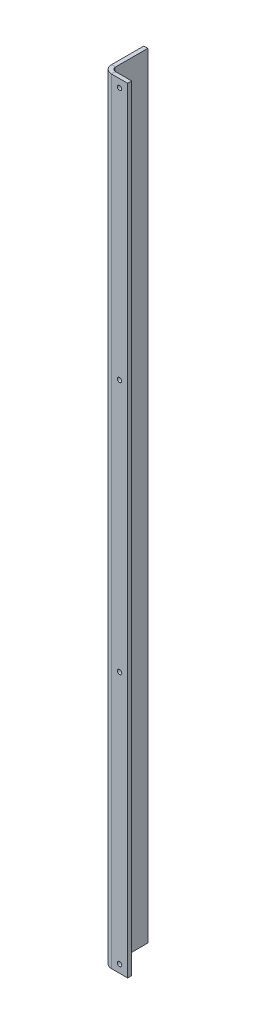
ISO-10303-21;
HEADER;
FILE_DESCRIPTION(('STEP AP214'),'2;1');
FILE_NAME('part.step','',(''),(''),'','','');
FILE_SCHEMA(('AUTOMOTIVE_DESIGN { 1 0 10303 214 1 1 1 1 }'));
ENDSEC;
DATA;
#1=APPLICATION_CONTEXT('core data for automotive mechanical design processes');
#2=APPLICATION_PROTOCOL_DEFINITION('international standard','automotive_design',2000,#1);
#3=PRODUCT_CONTEXT('',#1,'mechanical');
#4=PRODUCT('Part','Part','',(#3));
#5=PRODUCT_RELATED_PRODUCT_CATEGORY('part','',(#4));
#6=PRODUCT_DEFINITION_FORMATION('','',#4);
#7=PRODUCT_DEFINITION_CONTEXT('part definition',#1,'design');
#8=PRODUCT_DEFINITION('design','',#6,#7);
#9=PRODUCT_DEFINITION_SHAPE('','',#8);
#10=(LENGTH_UNIT() NAMED_UNIT(*) SI_UNIT(.MILLI.,.METRE.));
#11=(NAMED_UNIT(*) PLANE_ANGLE_UNIT() SI_UNIT($,.RADIAN.));
#12=(NAMED_UNIT(*) SI_UNIT($,.STERADIAN.) SOLID_ANGLE_UNIT());
#13=UNCERTAINTY_MEASURE_WITH_UNIT(LENGTH_MEASURE(1.E-05),#10,'distance_accuracy_value','');
#14=(GEOMETRIC_REPRESENTATION_CONTEXT(3) GLOBAL_UNCERTAINTY_ASSIGNED_CONTEXT((#13)) GLOBAL_UNIT_ASSIGNED_CONTEXT((#10,
#11,#12)) REPRESENTATION_CONTEXT('',''));
#15=CARTESIAN_POINT('',(0.,0.,0.));
#16=DIRECTION('',(0.,0.,1.));
#17=DIRECTION('',(1.,0.,0.));
#18=AXIS2_PLACEMENT_3D('',#15,#16,#17);
#19=CARTESIAN_POINT('',(0.,1219.2,-12.7));
#20=DIRECTION('',(0.,1.,0.));
#21=DIRECTION('',(0.,0.,1.));
#22=AXIS2_PLACEMENT_3D('',#19,#20,#21);
#23=PLANE('',#22);
#24=DIRECTION('',(1.,0.,0.));
#25=VECTOR('',#24,1.);
#26=CARTESIAN_POINT('',(0.,1219.2,-12.7));
#27=LINE('',#26,#25);
#28=CARTESIAN_POINT('',(0.,1219.2,-12.7));
#29=VERTEX_POINT('',#28);
#30=CARTESIAN_POINT('',(6.35,1219.2,-12.7));
#31=VERTEX_POINT('',#30);
#32=EDGE_CURVE('E51',#29,#31,#27,.T.);
#33=ORIENTED_EDGE('',*,*,#32,.F.);
#34=CARTESIAN_POINT('',(12.7,1219.2,-12.7));
#35=DIRECTION('',(0.,1.,0.));
#36=DIRECTION('',(0.,0.,1.));
#37=AXIS2_PLACEMENT_3D('',#34,#35,#36);
#38=CIRCLE('',#37,12.7);
#39=CARTESIAN_POINT('',(12.7,1219.2,0.));
#40=VERTEX_POINT('',#39);
#41=EDGE_CURVE('E135',#40,#29,#38,.F.);
#42=ORIENTED_EDGE('',*,*,#41,.F.);
#43=DIRECTION('',(0.,0.,1.));
#44=VECTOR('',#43,1.);
#45=CARTESIAN_POINT('',(12.7,1219.2,-6.35));
#46=LINE('',#45,#44);
#47=CARTESIAN_POINT('',(12.7,1219.2,-6.35));
#48=VERTEX_POINT('',#47);
#49=EDGE_CURVE('E176',#48,#40,#46,.T.);
#50=ORIENTED_EDGE('',*,*,#49,.F.);
#51=CARTESIAN_POINT('',(12.7,1219.2,-12.7));
#52=DIRECTION('',(0.,1.,0.));
#53=DIRECTION('',(1.,0.,0.));
#54=AXIS2_PLACEMENT_3D('',#51,#52,#53);
#55=CIRCLE('',#54,6.35);
#56=EDGE_CURVE('E128',#48,#31,#55,.F.);
#57=ORIENTED_EDGE('',*,*,#56,.T.);
#58=EDGE_LOOP('',(#33,#42,#50,#57));
#59=FACE_BOUND('',#58,.T.);
#60=ADVANCED_FACE('F34',(#59),#23,.T.);
#61=CARTESIAN_POINT('',(12.7,1219.2,-6.35));
#62=DIRECTION('',(0.,1.,0.));
#63=DIRECTION('',(0.,0.,1.));
#64=AXIS2_PLACEMENT_3D('',#61,#62,#63);
#65=PLANE('',#64);
#66=DIRECTION('',(0.,0.,-1.));
#67=VECTOR('',#66,1.);
#68=CARTESIAN_POINT('',(0.,1219.2,0.));
#69=LINE('',#68,#67);
#70=CARTESIAN_POINT('',(0.,1219.2,-63.5));
#71=VERTEX_POINT('',#70);
#72=EDGE_CURVE('E269',#29,#71,#69,.T.);
#73=ORIENTED_EDGE('',*,*,#72,.F.);
#74=ORIENTED_EDGE('',*,*,#32,.T.);
#75=DIRECTION('',(0.,0.,-1.));
#76=VECTOR('',#75,1.);
#77=CARTESIAN_POINT('',(6.35,1219.2,0.));
#78=LINE('',#77,#76);
#79=CARTESIAN_POINT('',(6.35,1219.2,-63.5));
#80=VERTEX_POINT('',#79);
#81=EDGE_CURVE('E93',#31,#80,#78,.T.);
#82=ORIENTED_EDGE('',*,*,#81,.T.);
#83=DIRECTION('',(1.,0.,0.));
#84=VECTOR('',#83,1.);
#85=CARTESIAN_POINT('',(0.,1219.2,-63.5));
#86=LINE('',#85,#84);
#87=EDGE_CURVE('E266',#71,#80,#86,.T.);
#88=ORIENTED_EDGE('',*,*,#87,.F.);
#89=EDGE_LOOP('',(#73,#74,#82,#88));
#90=FACE_BOUND('',#89,.T.);
#91=ADVANCED_FACE('F208',(#90),#65,.T.);
#92=CARTESIAN_POINT('',(12.7,0.,0.));
#93=DIRECTION('',(0.,-1.,0.));
#94=DIRECTION('',(0.,0.,-1.));
#95=AXIS2_PLACEMENT_3D('',#92,#93,#94);
#96=PLANE('',#95);
#97=DIRECTION('',(0.,0.,-1.));
#98=VECTOR('',#97,1.);
#99=CARTESIAN_POINT('',(12.7,0.,0.));
#100=LINE('',#99,#98);
#101=CARTESIAN_POINT('',(12.7,0.,0.));
#102=VERTEX_POINT('',#101);
#103=CARTESIAN_POINT('',(12.7,0.,-6.35));
#104=VERTEX_POINT('',#103);
#105=EDGE_CURVE('E80',#102,#104,#100,.T.);
#106=ORIENTED_EDGE('',*,*,#105,.F.);
#107=CARTESIAN_POINT('',(12.7,0.,-12.7));
#108=DIRECTION('',(0.,1.,0.));
#109=DIRECTION('',(0.,0.,1.));
#110=AXIS2_PLACEMENT_3D('',#107,#108,#109);
#111=CIRCLE('',#110,12.7);
#112=CARTESIAN_POINT('',(0.,0.,-12.7));
#113=VERTEX_POINT('',#112);
#114=EDGE_CURVE('E151',#102,#113,#111,.F.);
#115=ORIENTED_EDGE('',*,*,#114,.T.);
#116=DIRECTION('',(-1.,0.,0.));
#117=VECTOR('',#116,1.);
#118=CARTESIAN_POINT('',(6.35,0.,-12.7));
#119=LINE('',#118,#117);
#120=CARTESIAN_POINT('',(6.35,0.,-12.7));
#121=VERTEX_POINT('',#120);
#122=EDGE_CURVE('E87',#121,#113,#119,.T.);
#123=ORIENTED_EDGE('',*,*,#122,.F.);
#124=CARTESIAN_POINT('',(12.7,0.,-12.7));
#125=DIRECTION('',(0.,1.,0.));
#126=DIRECTION('',(1.,0.,0.));
#127=AXIS2_PLACEMENT_3D('',#124,#125,#126);
#128=CIRCLE('',#127,6.35);
#129=EDGE_CURVE('E158',#104,#121,#128,.F.);
#130=ORIENTED_EDGE('',*,*,#129,.F.);
#131=EDGE_LOOP('',(#106,#115,#123,#130));
#132=FACE_BOUND('',#131,.T.);
#133=ADVANCED_FACE('F214',(#132),#96,.T.);
#134=CARTESIAN_POINT('',(6.35,0.,-12.7));
#135=DIRECTION('',(0.,-1.,0.));
#136=DIRECTION('',(0.,0.,-1.));
#137=AXIS2_PLACEMENT_3D('',#134,#135,#136);
#138=PLANE('',#137);
#139=DIRECTION('',(-1.,0.,0.));
#140=VECTOR('',#139,1.);
#141=CARTESIAN_POINT('',(0.,0.,0.));
#142=LINE('',#141,#140);
#143=CARTESIAN_POINT('',(38.1,0.,0.));
#144=VERTEX_POINT('',#143);
#145=EDGE_CURVE('E153',#144,#102,#142,.T.);
#146=ORIENTED_EDGE('',*,*,#145,.T.);
#147=ORIENTED_EDGE('',*,*,#105,.T.);
#148=DIRECTION('',(1.,0.,0.));
#149=VECTOR('',#148,1.);
#150=CARTESIAN_POINT('',(0.,0.,-6.35));
#151=LINE('',#150,#149);
#152=CARTESIAN_POINT('',(38.1,0.,-6.35));
#153=VERTEX_POINT('',#152);
#154=EDGE_CURVE('E156',#153,#104,#151,.F.);
#155=ORIENTED_EDGE('',*,*,#154,.F.);
#156=DIRECTION('',(0.,0.,1.));
#157=VECTOR('',#156,1.);
#158=CARTESIAN_POINT('',(38.1,0.,-6.35));
#159=LINE('',#158,#157);
#160=EDGE_CURVE('E115',#153,#144,#159,.T.);
#161=ORIENTED_EDGE('',*,*,#160,.T.);
#162=EDGE_LOOP('',(#146,#147,#155,#161));
#163=FACE_BOUND('',#162,.T.);
#164=ADVANCED_FACE('F280',(#163),#138,.T.);
#165=CARTESIAN_POINT('',(6.35,1219.2,0.));
#166=DIRECTION('',(-1.,0.,0.));
#167=DIRECTION('',(0.,0.,1.));
#168=AXIS2_PLACEMENT_3D('',#165,#166,#167);
#169=PLANE('',#168);
#170=DIRECTION('',(0.,0.,-1.));
#171=VECTOR('',#170,1.);
#172=CARTESIAN_POINT('',(6.35,0.,0.));
#173=LINE('',#172,#171);
#174=CARTESIAN_POINT('',(6.35,0.,-63.5));
#175=VERTEX_POINT('',#174);
#176=EDGE_CURVE('E141',#121,#175,#173,.T.);
#177=ORIENTED_EDGE('',*,*,#176,.T.);
#178=DIRECTION('',(0.,-1.,0.));
#179=VECTOR('',#178,1.);
#180=CARTESIAN_POINT('',(6.35,1219.2,-63.5));
#181=LINE('',#180,#179);
#182=EDGE_CURVE('E172',#80,#175,#181,.T.);
#183=ORIENTED_EDGE('',*,*,#182,.F.);
#184=ORIENTED_EDGE('',*,*,#81,.F.);
#185=DIRECTION('',(0.,-1.,0.));
#186=VECTOR('',#185,1.);
#187=CARTESIAN_POINT('',(6.35,1219.2,-12.7));
#188=LINE('',#187,#186);
#189=EDGE_CURVE('E140',#31,#121,#188,.T.);
#190=ORIENTED_EDGE('',*,*,#189,.T.);
#191=EDGE_LOOP('',(#177,#183,#184,#190));
#192=FACE_BOUND('',#191,.T.);
#193=ADVANCED_FACE('F286',(#192),#169,.F.);
#194=CARTESIAN_POINT('',(0.,1219.2,-63.5));
#195=DIRECTION('',(0.,0.,-1.));
#196=DIRECTION('',(-1.,0.,0.));
#197=AXIS2_PLACEMENT_3D('',#194,#195,#196);
#198=PLANE('',#197);
#199=DIRECTION('',(1.,0.,0.));
#200=VECTOR('',#199,1.);
#201=CARTESIAN_POINT('',(0.,0.,-63.5));
#202=LINE('',#201,#200);
#203=CARTESIAN_POINT('',(0.,0.,-63.5));
#204=VERTEX_POINT('',#203);
#205=EDGE_CURVE('E144',#204,#175,#202,.T.);
#206=ORIENTED_EDGE('',*,*,#205,.F.);
#207=DIRECTION('',(0.,-1.,0.));
#208=VECTOR('',#207,1.);
#209=CARTESIAN_POINT('',(0.,1219.2,-63.5));
#210=LINE('',#209,#208);
#211=EDGE_CURVE('E170',#71,#204,#210,.T.);
#212=ORIENTED_EDGE('',*,*,#211,.F.);
#213=ORIENTED_EDGE('',*,*,#87,.T.);
#214=ORIENTED_EDGE('',*,*,#182,.T.);
#215=EDGE_LOOP('',(#206,#212,#213,#214));
#216=FACE_BOUND('',#215,.T.);
#217=ADVANCED_FACE('F291',(#216),#198,.T.);
#218=CARTESIAN_POINT('',(0.,1219.2,0.));
#219=DIRECTION('',(-1.,0.,0.));
#220=DIRECTION('',(0.,0.,1.));
#221=AXIS2_PLACEMENT_3D('',#218,#219,#220);
#222=PLANE('',#221);
#223=DIRECTION('',(0.,0.,-1.));
#224=VECTOR('',#223,1.);
#225=CARTESIAN_POINT('',(0.,0.,0.));
#226=LINE('',#225,#224);
#227=EDGE_CURVE('E148',#113,#204,#226,.T.);
#228=ORIENTED_EDGE('',*,*,#227,.F.);
#229=DIRECTION('',(0.,-1.,0.));
#230=VECTOR('',#229,1.);
#231=CARTESIAN_POINT('',(0.,1219.2,-12.7));
#232=LINE('',#231,#230);
#233=EDGE_CURVE('E167',#29,#113,#232,.T.);
#234=ORIENTED_EDGE('',*,*,#233,.F.);
#235=ORIENTED_EDGE('',*,*,#72,.T.);
#236=ORIENTED_EDGE('',*,*,#211,.T.);
#237=EDGE_LOOP('',(#228,#234,#235,#236));
#238=FACE_BOUND('',#237,.T.);
#239=ADVANCED_FACE('F202',(#238),#222,.T.);
#240=CARTESIAN_POINT('',(12.7,1219.2,-12.7));
#241=DIRECTION('',(0.,-1.,0.));
#242=DIRECTION('',(0.,0.,-1.));
#243=AXIS2_PLACEMENT_3D('',#240,#241,#242);
#244=CYLINDRICAL_SURFACE('',#243,12.7);
#245=ORIENTED_EDGE('',*,*,#114,.F.);
#246=DIRECTION('',(0.,-1.,0.));
#247=VECTOR('',#246,1.);
#248=CARTESIAN_POINT('',(12.7,1219.2,0.));
#249=LINE('',#248,#247);
#250=EDGE_CURVE('E164',#40,#102,#249,.T.);
#251=ORIENTED_EDGE('',*,*,#250,.F.);
#252=ORIENTED_EDGE('',*,*,#41,.T.);
#253=ORIENTED_EDGE('',*,*,#233,.T.);
#254=EDGE_LOOP('',(#245,#251,#252,#253));
#255=FACE_BOUND('',#254,.T.);
#256=ADVANCED_FACE('F194',(#255),#244,.T.);
#257=CARTESIAN_POINT('',(0.,1219.2,0.));
#258=DIRECTION('',(0.,0.,1.));
#259=DIRECTION('',(1.,0.,0.));
#260=AXIS2_PLACEMENT_3D('',#257,#258,#259);
#261=PLANE('',#260);
#262=CARTESIAN_POINT('',(25.4,808.56836,0.));
#263=DIRECTION('',(0.,0.,1.));
#264=DIRECTION('',(1.,0.,0.));
#265=AXIS2_PLACEMENT_3D('',#262,#263,#264);
#266=CIRCLE('',#265,3.429);
#267=CARTESIAN_POINT('',(28.829,808.56836,0.));
#268=VERTEX_POINT('',#267);
#269=EDGE_CURVE('E261',#268,#268,#266,.T.);
#270=ORIENTED_EDGE('',*,*,#269,.F.);
#271=EDGE_LOOP('',(#270));
#272=FACE_BOUND('',#271,.T.);
#273=CARTESIAN_POINT('',(25.4,1206.5,0.));
#274=DIRECTION('',(0.,0.,1.));
#275=DIRECTION('',(1.,0.,0.));
#276=AXIS2_PLACEMENT_3D('',#273,#274,#275);
#277=CIRCLE('',#276,3.429);
#278=CARTESIAN_POINT('',(28.829,1206.5,0.));
#279=VERTEX_POINT('',#278);
#280=EDGE_CURVE('E182',#279,#279,#277,.T.);
#281=ORIENTED_EDGE('',*,*,#280,.F.);
#282=EDGE_LOOP('',(#281));
#283=FACE_BOUND('',#282,.T.);
#284=ORIENTED_EDGE('',*,*,#145,.F.);
#285=DIRECTION('',(0.,-1.,0.));
#286=VECTOR('',#285,1.);
#287=CARTESIAN_POINT('',(38.1,1219.2,0.));
#288=LINE('',#287,#286);
#289=CARTESIAN_POINT('',(38.1,1219.2,0.));
#290=VERTEX_POINT('',#289);
#291=EDGE_CURVE('E117',#290,#144,#288,.T.);
#292=ORIENTED_EDGE('',*,*,#291,.F.);
#293=DIRECTION('',(-1.,0.,0.));
#294=VECTOR('',#293,1.);
#295=CARTESIAN_POINT('',(0.,1219.2,0.));
#296=LINE('',#295,#294);
#297=EDGE_CURVE('E133',#290,#40,#296,.T.);
#298=ORIENTED_EDGE('',*,*,#297,.T.);
#299=ORIENTED_EDGE('',*,*,#250,.T.);
#300=EDGE_LOOP('',(#284,#292,#298,#299));
#301=FACE_BOUND('',#300,.T.);
#302=CARTESIAN_POINT('',(25.4,410.63672,0.));
#303=DIRECTION('',(0.,0.,1.));
#304=DIRECTION('',(1.,0.,0.));
#305=AXIS2_PLACEMENT_3D('',#302,#303,#304);
#306=CIRCLE('',#305,3.429);
#307=CARTESIAN_POINT('',(28.829,410.63672,0.));
#308=VERTEX_POINT('',#307);
#309=EDGE_CURVE('E179',#308,#308,#306,.T.);
#310=ORIENTED_EDGE('',*,*,#309,.F.);
#311=EDGE_LOOP('',(#310));
#312=FACE_BOUND('',#311,.T.);
#313=CARTESIAN_POINT('',(25.4,12.7050799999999,0.));
#314=DIRECTION('',(0.,0.,1.));
#315=DIRECTION('',(1.,0.,0.));
#316=AXIS2_PLACEMENT_3D('',#313,#314,#315);
#317=CIRCLE('',#316,3.429);
#318=CARTESIAN_POINT('',(28.829,12.7050799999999,0.));
#319=VERTEX_POINT('',#318);
#320=EDGE_CURVE('E43',#319,#319,#317,.T.);
#321=ORIENTED_EDGE('',*,*,#320,.F.);
#322=EDGE_LOOP('',(#321));
#323=FACE_BOUND('',#322,.T.);
#324=ADVANCED_FACE('F192',(#272,#283,#301,#312,#323),#261,.T.);
#325=CARTESIAN_POINT('',(38.1,1219.2,-6.35));
#326=DIRECTION('',(1.,0.,0.));
#327=DIRECTION('',(0.,0.,-1.));
#328=AXIS2_PLACEMENT_3D('',#325,#326,#327);
#329=PLANE('',#328);
#330=ORIENTED_EDGE('',*,*,#160,.F.);
#331=DIRECTION('',(0.,-1.,0.));
#332=VECTOR('',#331,1.);
#333=CARTESIAN_POINT('',(38.1,1219.2,-6.35));
#334=LINE('',#333,#332);
#335=CARTESIAN_POINT('',(38.1,1219.2,-6.35));
#336=VERTEX_POINT('',#335);
#337=EDGE_CURVE('E109',#336,#153,#334,.T.);
#338=ORIENTED_EDGE('',*,*,#337,.F.);
#339=DIRECTION('',(0.,0.,1.));
#340=VECTOR('',#339,1.);
#341=CARTESIAN_POINT('',(38.1,1219.2,-6.35));
#342=LINE('',#341,#340);
#343=EDGE_CURVE('E113',#336,#290,#342,.T.);
#344=ORIENTED_EDGE('',*,*,#343,.T.);
#345=ORIENTED_EDGE('',*,*,#291,.T.);
#346=EDGE_LOOP('',(#330,#338,#344,#345));
#347=FACE_BOUND('',#346,.T.);
#348=ADVANCED_FACE('F111',(#347),#329,.T.);
#349=CARTESIAN_POINT('',(0.,1219.2,-6.35));
#350=DIRECTION('',(0.,0.,1.));
#351=DIRECTION('',(1.,0.,0.));
#352=AXIS2_PLACEMENT_3D('',#349,#350,#351);
#353=PLANE('',#352);
#354=CARTESIAN_POINT('',(25.4,808.56836,-6.35));
#355=DIRECTION('',(0.,0.,1.));
#356=DIRECTION('',(1.,0.,0.));
#357=AXIS2_PLACEMENT_3D('',#354,#355,#356);
#358=CIRCLE('',#357,3.429);
#359=CARTESIAN_POINT('',(28.829,808.56836,-6.35));
#360=VERTEX_POINT('',#359);
#361=EDGE_CURVE('E259',#360,#360,#358,.T.);
#362=ORIENTED_EDGE('',*,*,#361,.T.);
#363=EDGE_LOOP('',(#362));
#364=FACE_BOUND('',#363,.T.);
#365=CARTESIAN_POINT('',(25.4,1206.5,-6.35));
#366=DIRECTION('',(0.,0.,1.));
#367=DIRECTION('',(1.,0.,0.));
#368=AXIS2_PLACEMENT_3D('',#365,#366,#367);
#369=CIRCLE('',#368,3.429);
#370=CARTESIAN_POINT('',(28.829,1206.5,-6.35));
#371=VERTEX_POINT('',#370);
#372=EDGE_CURVE('E145',#371,#371,#369,.T.);
#373=ORIENTED_EDGE('',*,*,#372,.T.);
#374=EDGE_LOOP('',(#373));
#375=FACE_BOUND('',#374,.T.);
#376=ORIENTED_EDGE('',*,*,#154,.T.);
#377=DIRECTION('',(0.,-1.,0.));
#378=VECTOR('',#377,1.);
#379=CARTESIAN_POINT('',(12.7,1219.2,-6.35));
#380=LINE('',#379,#378);
#381=EDGE_CURVE('E118',#48,#104,#380,.T.);
#382=ORIENTED_EDGE('',*,*,#381,.F.);
#383=DIRECTION('',(1.,0.,0.));
#384=VECTOR('',#383,1.);
#385=CARTESIAN_POINT('',(0.,1219.2,-6.35));
#386=LINE('',#385,#384);
#387=EDGE_CURVE('E122',#336,#48,#386,.F.);
#388=ORIENTED_EDGE('',*,*,#387,.F.);
#389=ORIENTED_EDGE('',*,*,#337,.T.);
#390=EDGE_LOOP('',(#376,#382,#388,#389));
#391=FACE_BOUND('',#390,.T.);
#392=CARTESIAN_POINT('',(25.4,410.63672,-6.35));
#393=DIRECTION('',(0.,0.,1.));
#394=DIRECTION('',(1.,0.,0.));
#395=AXIS2_PLACEMENT_3D('',#392,#393,#394);
#396=CIRCLE('',#395,3.429);
#397=CARTESIAN_POINT('',(28.829,410.63672,-6.35));
#398=VERTEX_POINT('',#397);
#399=EDGE_CURVE('E185',#398,#398,#396,.T.);
#400=ORIENTED_EDGE('',*,*,#399,.T.);
#401=EDGE_LOOP('',(#400));
#402=FACE_BOUND('',#401,.T.);
#403=CARTESIAN_POINT('',(25.4,12.7050799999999,-6.35));
#404=DIRECTION('',(0.,0.,1.));
#405=DIRECTION('',(1.,0.,0.));
#406=AXIS2_PLACEMENT_3D('',#403,#404,#405);
#407=CIRCLE('',#406,3.429);
#408=CARTESIAN_POINT('',(28.829,12.7050799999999,-6.35));
#409=VERTEX_POINT('',#408);
#410=EDGE_CURVE('E11',#409,#409,#407,.T.);
#411=ORIENTED_EDGE('',*,*,#410,.T.);
#412=EDGE_LOOP('',(#411));
#413=FACE_BOUND('',#412,.T.);
#414=ADVANCED_FACE('F123',(#364,#375,#391,#402,#413),#353,.F.);
#415=CARTESIAN_POINT('',(12.7,1219.2,-12.7));
#416=DIRECTION('',(0.,-1.,0.));
#417=DIRECTION('',(0.,0.,-1.));
#418=AXIS2_PLACEMENT_3D('',#415,#416,#417);
#419=CYLINDRICAL_SURFACE('',#418,6.35);
#420=ORIENTED_EDGE('',*,*,#129,.T.);
#421=ORIENTED_EDGE('',*,*,#189,.F.);
#422=ORIENTED_EDGE('',*,*,#56,.F.);
#423=ORIENTED_EDGE('',*,*,#381,.T.);
#424=EDGE_LOOP('',(#420,#421,#422,#423));
#425=FACE_BOUND('',#424,.T.);
#426=ADVANCED_FACE('F233',(#425),#419,.F.);
#427=CARTESIAN_POINT('',(12.7,1219.2,-12.7));
#428=DIRECTION('',(0.,1.,0.));
#429=DIRECTION('',(1.,0.,0.));
#430=AXIS2_PLACEMENT_3D('',#427,#428,#429);
#431=PLANE('',#430);
#432=ORIENTED_EDGE('',*,*,#387,.T.);
#433=ORIENTED_EDGE('',*,*,#49,.T.);
#434=ORIENTED_EDGE('',*,*,#297,.F.);
#435=ORIENTED_EDGE('',*,*,#343,.F.);
#436=EDGE_LOOP('',(#432,#433,#434,#435));
#437=FACE_BOUND('',#436,.T.);
#438=ADVANCED_FACE('F131',(#437),#431,.T.);
#439=CARTESIAN_POINT('',(12.7,0.,-12.7));
#440=DIRECTION('',(0.,1.,0.));
#441=DIRECTION('',(1.,0.,0.));
#442=AXIS2_PLACEMENT_3D('',#439,#440,#441);
#443=PLANE('',#442);
#444=ORIENTED_EDGE('',*,*,#176,.F.);
#445=ORIENTED_EDGE('',*,*,#122,.T.);
#446=ORIENTED_EDGE('',*,*,#227,.T.);
#447=ORIENTED_EDGE('',*,*,#205,.T.);
#448=EDGE_LOOP('',(#444,#445,#446,#447));
#449=FACE_BOUND('',#448,.T.);
#450=ADVANCED_FACE('F245',(#449),#443,.F.);
#451=CARTESIAN_POINT('',(25.4,1206.5,-63.5));
#452=DIRECTION('',(0.,0.,1.));
#453=DIRECTION('',(1.,0.,0.));
#454=AXIS2_PLACEMENT_3D('',#451,#452,#453);
#455=CYLINDRICAL_SURFACE('',#454,3.429);
#456=ORIENTED_EDGE('',*,*,#280,.T.);
#457=EDGE_LOOP('',(#456));
#458=FACE_BOUND('',#457,.T.);
#459=ORIENTED_EDGE('',*,*,#372,.F.);
#460=EDGE_LOOP('',(#459));
#461=FACE_BOUND('',#460,.T.);
#462=ADVANCED_FACE('F225',(#458,#461),#455,.F.);
#463=CARTESIAN_POINT('',(25.4,808.56836,-63.5));
#464=DIRECTION('',(0.,0.,1.));
#465=DIRECTION('',(1.,0.,0.));
#466=AXIS2_PLACEMENT_3D('',#463,#464,#465);
#467=CYLINDRICAL_SURFACE('',#466,3.429);
#468=ORIENTED_EDGE('',*,*,#269,.T.);
#469=EDGE_LOOP('',(#468));
#470=FACE_BOUND('',#469,.T.);
#471=ORIENTED_EDGE('',*,*,#361,.F.);
#472=EDGE_LOOP('',(#471));
#473=FACE_BOUND('',#472,.T.);
#474=ADVANCED_FACE('F219',(#470,#473),#467,.F.);
#475=CARTESIAN_POINT('',(25.4,410.63672,-63.5));
#476=DIRECTION('',(0.,0.,1.));
#477=DIRECTION('',(1.,0.,0.));
#478=AXIS2_PLACEMENT_3D('',#475,#476,#477);
#479=CYLINDRICAL_SURFACE('',#478,3.429);
#480=ORIENTED_EDGE('',*,*,#309,.T.);
#481=EDGE_LOOP('',(#480));
#482=FACE_BOUND('',#481,.T.);
#483=ORIENTED_EDGE('',*,*,#399,.F.);
#484=EDGE_LOOP('',(#483));
#485=FACE_BOUND('',#484,.T.);
#486=ADVANCED_FACE('F217',(#482,#485),#479,.F.);
#487=CARTESIAN_POINT('',(25.4,12.7050799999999,-63.5));
#488=DIRECTION('',(0.,0.,1.));
#489=DIRECTION('',(1.,0.,0.));
#490=AXIS2_PLACEMENT_3D('',#487,#488,#489);
#491=CYLINDRICAL_SURFACE('',#490,3.429);
#492=ORIENTED_EDGE('',*,*,#320,.T.);
#493=EDGE_LOOP('',(#492));
#494=FACE_BOUND('',#493,.T.);
#495=ORIENTED_EDGE('',*,*,#410,.F.);
#496=EDGE_LOOP('',(#495));
#497=FACE_BOUND('',#496,.T.);
#498=ADVANCED_FACE('F36',(#494,#497),#491,.F.);
#499=CLOSED_SHELL('',(#60,#91,#133,#164,#193,#217,#239,#256,#324,#348,#414,#426,#438,#450,#462,
#474,#486,#498));
#500=MANIFOLD_SOLID_BREP('B2',#499);
#501=ADVANCED_BREP_SHAPE_REPRESENTATION('',(#18,#500),#14);
#502=SHAPE_DEFINITION_REPRESENTATION(#9,#501);
ENDSEC;
END-ISO-10303-21;
